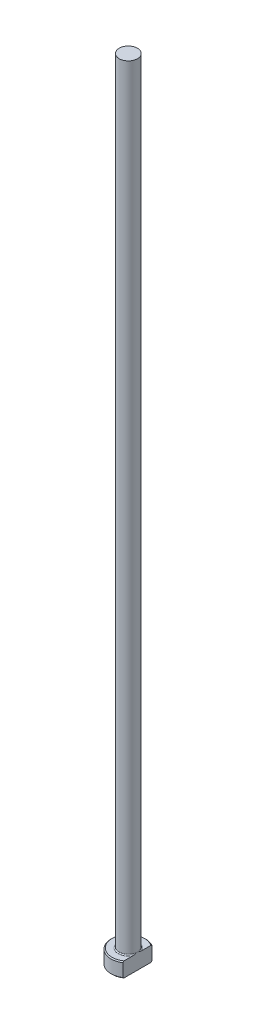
from build123d import *
from build123d.topology import SkipClean

# Parameters (mm, degrees)
CHAMFER1_SIZE = 0.2
FILLET1_R     = 0.2
KEY_DEPTH     = 161.076544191


with BuildPart() as part:
    # Sketch1 → Revolve1 (revolve)
    with BuildSketch(Plane.XY, mode=Mode.PRIVATE) as revolve1_sk:
        Polygon((0, 0), (-3.5, 0), (-3.5, 3), (-1.85, 3), (-1.85, 160), (0, 160), align=None)
    revolve(revolve1_sk.sketch.rotate(Axis((0, 259.958771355, 0), (0, -1, 0)), 270), axis=Axis((0, 259.958771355, 0), (0, -1, 0)))

    # Chamfer1
    chamfer1_edges = [part.edges().sort_by_distance(p)[0] for p in [
        (0, 3, -3.5),
        (0, 0, -3.5),
    ]]
    chamfer(chamfer1_edges, length=CHAMFER1_SIZE)

    # Fillet1
    fillet1_edges = [part.edges().sort_by_distance(p)[0] for p in [
        (0, 3, -1.85),
    ]]
    fillet(fillet1_edges, radius=FILLET1_R)

    # Sketch2 → KEY (cut, through all)
    with SkipClean():  # the faces are left unmerged after this step: merging them gives an invalid solid
        with BuildSketch(Plane(origin=(0, 0, 0), x_dir=(1, 0, 0), z_dir=(0, 1, 0))):
            with BuildLine():
                Line((1.85, 2.971110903), (1.85, -2.971110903))
                ThreePointArc((1.85, -2.971110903), (3.5, 0), (1.85, 2.971110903))
            make_face()
        extrude(amount=KEY_DEPTH, mode=Mode.SUBTRACT)


solid = part.part
